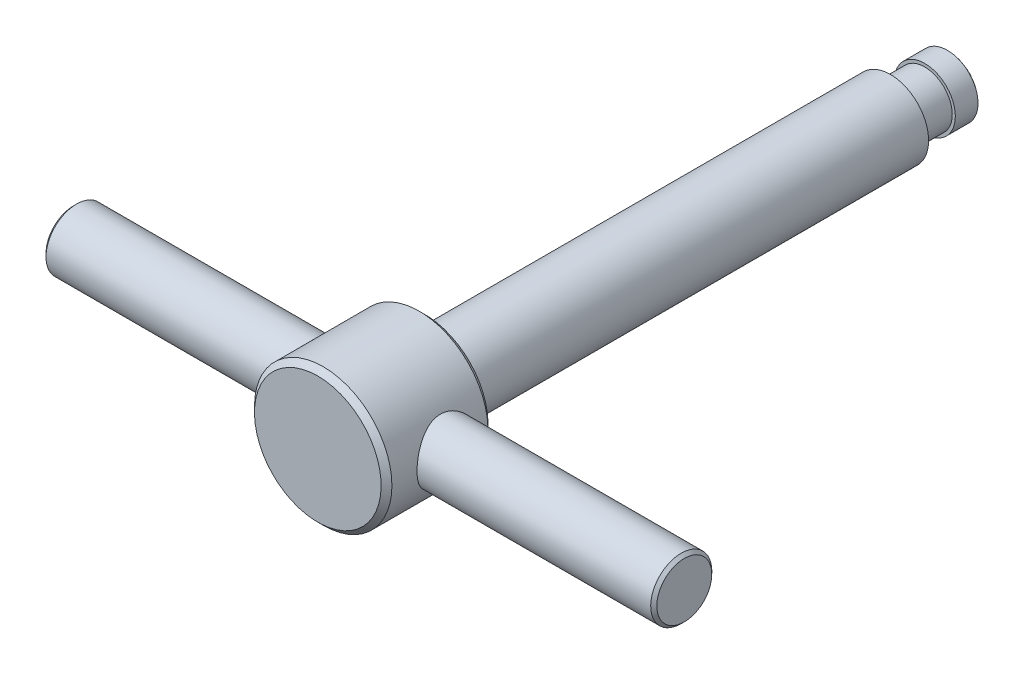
ISO-10303-21;
HEADER;
FILE_DESCRIPTION(('STEP AP214'),'2;1');
FILE_NAME('part.step','',(''),(''),'','','');
FILE_SCHEMA(('AUTOMOTIVE_DESIGN { 1 0 10303 214 1 1 1 1 }'));
ENDSEC;
DATA;
#1=APPLICATION_CONTEXT('core data for automotive mechanical design processes');
#2=APPLICATION_PROTOCOL_DEFINITION('international standard','automotive_design',2000,#1);
#3=PRODUCT_CONTEXT('',#1,'mechanical');
#4=PRODUCT('Part','Part','',(#3));
#5=PRODUCT_RELATED_PRODUCT_CATEGORY('part','',(#4));
#6=PRODUCT_DEFINITION_FORMATION('','',#4);
#7=PRODUCT_DEFINITION_CONTEXT('part definition',#1,'design');
#8=PRODUCT_DEFINITION('design','',#6,#7);
#9=PRODUCT_DEFINITION_SHAPE('','',#8);
#10=(LENGTH_UNIT() NAMED_UNIT(*) SI_UNIT(.MILLI.,.METRE.));
#11=(NAMED_UNIT(*) PLANE_ANGLE_UNIT() SI_UNIT($,.RADIAN.));
#12=(NAMED_UNIT(*) SI_UNIT($,.STERADIAN.) SOLID_ANGLE_UNIT());
#13=UNCERTAINTY_MEASURE_WITH_UNIT(LENGTH_MEASURE(1.E-05),#10,'distance_accuracy_value','');
#14=(GEOMETRIC_REPRESENTATION_CONTEXT(3) GLOBAL_UNCERTAINTY_ASSIGNED_CONTEXT((#13)) GLOBAL_UNIT_ASSIGNED_CONTEXT((#10,
#11,#12)) REPRESENTATION_CONTEXT('',''));
#15=CARTESIAN_POINT('',(0.,0.,0.));
#16=DIRECTION('',(0.,0.,1.));
#17=DIRECTION('',(1.,0.,0.));
#18=AXIS2_PLACEMENT_3D('',#15,#16,#17);
#19=CARTESIAN_POINT('',(40.,0.,79.6));
#20=DIRECTION('',(-1.,0.,0.));
#21=DIRECTION('',(0.,-1.,0.));
#22=AXIS2_PLACEMENT_3D('',#19,#20,#21);
#23=PLANE('',#22);
#24=CARTESIAN_POINT('',(40.0000000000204,0.,76.));
#25=DIRECTION('',(-1.,0.,0.));
#26=DIRECTION('',(0.,-1.,0.));
#27=AXIS2_PLACEMENT_3D('',#24,#25,#26);
#28=CIRCLE('',#27,3.59999999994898);
#29=CARTESIAN_POINT('',(40.0000000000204,-3.59999999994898,76.));
#30=VERTEX_POINT('',#29);
#31=EDGE_CURVE('E15',#30,#30,#28,.T.);
#32=ORIENTED_EDGE('',*,*,#31,.F.);
#33=EDGE_LOOP('',(#32));
#34=FACE_BOUND('',#33,.T.);
#35=ADVANCED_FACE('F12',(#34),#23,.F.);
#36=CARTESIAN_POINT('',(-40.,0.,76.));
#37=DIRECTION('',(1.,0.,0.));
#38=DIRECTION('',(0.,1.,0.));
#39=AXIS2_PLACEMENT_3D('',#36,#37,#38);
#40=PLANE('',#39);
#41=CARTESIAN_POINT('',(-40.0000000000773,0.,76.));
#42=DIRECTION('',(1.,0.,0.));
#43=DIRECTION('',(0.,1.,0.));
#44=AXIS2_PLACEMENT_3D('',#41,#42,#43);
#45=CIRCLE('',#44,3.60000000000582);
#46=CARTESIAN_POINT('',(-40.0000000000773,3.60000000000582,76.));
#47=VERTEX_POINT('',#46);
#48=EDGE_CURVE('E133',#47,#47,#45,.T.);
#49=ORIENTED_EDGE('',*,*,#48,.F.);
#50=EDGE_LOOP('',(#49));
#51=FACE_BOUND('',#50,.T.);
#52=ADVANCED_FACE('F171',(#51),#40,.F.);
#53=CARTESIAN_POINT('',(0.,0.,6.));
#54=DIRECTION('',(-1.,0.,0.));
#55=DIRECTION('',(0.,1.,0.));
#56=AXIS2_PLACEMENT_3D('',#53,#54,#55);
#57=SPHERICAL_SURFACE('',#56,6.);
#58=CARTESIAN_POINT('',(0.,0.,1.52786404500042));
#59=DIRECTION('',(0.,0.,1.));
#60=DIRECTION('',(0.,-1.,0.));
#61=AXIS2_PLACEMENT_3D('',#58,#59,#60);
#62=CIRCLE('',#61,4.);
#63=CARTESIAN_POINT('',(0.,-4.,1.52786404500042));
#64=VERTEX_POINT('',#63);
#65=EDGE_CURVE('E126',#64,#64,#62,.T.);
#66=ORIENTED_EDGE('',*,*,#65,.F.);
#67=EDGE_LOOP('',(#66));
#68=FACE_BOUND('',#67,.T.);
#69=ADVANCED_FACE('F168',(#68),#57,.T.);
#70=CARTESIAN_POINT('',(39.6000000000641,0.,76.));
#71=DIRECTION('',(-1.,0.,0.));
#72=DIRECTION('',(0.,-1.,0.));
#73=AXIS2_PLACEMENT_3D('',#70,#71,#72);
#74=CONICAL_SURFACE('',#73,3.99999999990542,0.785398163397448);
#75=CARTESIAN_POINT('',(39.6,0.,76.));
#76=DIRECTION('',(-1.,0.,0.));
#77=DIRECTION('',(0.,-1.,0.));
#78=AXIS2_PLACEMENT_3D('',#75,#76,#77);
#79=CIRCLE('',#78,4.);
#80=CARTESIAN_POINT('',(39.6,-4.,76.));
#81=VERTEX_POINT('',#80);
#82=EDGE_CURVE('E124',#81,#81,#79,.T.);
#83=ORIENTED_EDGE('',*,*,#82,.F.);
#84=EDGE_LOOP('',(#83));
#85=FACE_BOUND('',#84,.T.);
#86=ORIENTED_EDGE('',*,*,#31,.T.);
#87=EDGE_LOOP('',(#86));
#88=FACE_BOUND('',#87,.T.);
#89=ADVANCED_FACE('F164',(#85,#88),#74,.T.);
#90=CARTESIAN_POINT('',(0.,0.,84.));
#91=DIRECTION('',(0.,0.,-1.));
#92=DIRECTION('',(0.,1.,0.));
#93=AXIS2_PLACEMENT_3D('',#90,#91,#92);
#94=PLANE('',#93);
#95=CARTESIAN_POINT('',(0.,0.,84.));
#96=DIRECTION('',(0.,0.,-1.));
#97=DIRECTION('',(0.,1.,0.));
#98=AXIS2_PLACEMENT_3D('',#95,#96,#97);
#99=CIRCLE('',#98,8.29289321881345);
#100=CARTESIAN_POINT('',(0.,8.29289321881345,84.));
#101=VERTEX_POINT('',#100);
#102=EDGE_CURVE('E121',#101,#101,#99,.T.);
#103=ORIENTED_EDGE('',*,*,#102,.F.);
#104=EDGE_LOOP('',(#103));
#105=FACE_BOUND('',#104,.T.);
#106=ADVANCED_FACE('F160',(#105),#94,.F.);
#107=CARTESIAN_POINT('',(-39.6000000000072,0.,76.));
#108=DIRECTION('',(1.,0.,0.));
#109=DIRECTION('',(0.,1.,0.));
#110=AXIS2_PLACEMENT_3D('',#107,#108,#109);
#111=CONICAL_SURFACE('',#110,4.00000000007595,0.785398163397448);
#112=ORIENTED_EDGE('',*,*,#48,.T.);
#113=EDGE_LOOP('',(#112));
#114=FACE_BOUND('',#113,.T.);
#115=CARTESIAN_POINT('',(-39.6,0.,76.));
#116=DIRECTION('',(-1.,0.,0.));
#117=DIRECTION('',(0.,-1.,0.));
#118=AXIS2_PLACEMENT_3D('',#115,#116,#117);
#119=CIRCLE('',#118,4.);
#120=CARTESIAN_POINT('',(-39.6,-4.,76.));
#121=VERTEX_POINT('',#120);
#122=EDGE_CURVE('E117',#121,#121,#119,.F.);
#123=ORIENTED_EDGE('',*,*,#122,.F.);
#124=EDGE_LOOP('',(#123));
#125=FACE_BOUND('',#124,.T.);
#126=ADVANCED_FACE('F154',(#114,#125),#111,.T.);
#127=CARTESIAN_POINT('',(0.,0.,0.));
#128=DIRECTION('',(0.,0.,1.));
#129=DIRECTION('',(0.,-1.,0.));
#130=AXIS2_PLACEMENT_3D('',#127,#128,#129);
#131=CYLINDRICAL_SURFACE('',#130,4.);
#132=CARTESIAN_POINT('',(0.,0.,4.5));
#133=DIRECTION('',(0.,0.,1.));
#134=DIRECTION('',(0.,-1.,0.));
#135=AXIS2_PLACEMENT_3D('',#132,#133,#134);
#136=CIRCLE('',#135,4.);
#137=CARTESIAN_POINT('',(0.,-4.,4.5));
#138=VERTEX_POINT('',#137);
#139=EDGE_CURVE('E120',#138,#138,#136,.F.);
#140=ORIENTED_EDGE('',*,*,#139,.T.);
#141=EDGE_LOOP('',(#140));
#142=FACE_BOUND('',#141,.T.);
#143=ORIENTED_EDGE('',*,*,#65,.T.);
#144=EDGE_LOOP('',(#143));
#145=FACE_BOUND('',#144,.T.);
#146=ADVANCED_FACE('F147',(#142,#145),#131,.T.);
#147=CARTESIAN_POINT('',(40.,0.,76.));
#148=DIRECTION('',(-1.,0.,0.));
#149=DIRECTION('',(0.,-1.,0.));
#150=AXIS2_PLACEMENT_3D('',#147,#148,#149);
#151=CYLINDRICAL_SURFACE('',#150,4.);
#152=CARTESIAN_POINT('',(8.06476391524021,3.99494467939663,75.798960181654));
#153=CARTESIAN_POINT('',(8.0674363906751,3.98955069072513,75.6917916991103));
#154=CARTESIAN_POINT('',(8.07224351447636,3.97984050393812,75.5848598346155));
#155=CARTESIAN_POINT('',(8.08595698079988,3.95190310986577,75.3723346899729));
#156=CARTESIAN_POINT('',(8.09486596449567,3.93367041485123,75.2667423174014));
#157=CARTESIAN_POINT('',(8.1164936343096,3.88884963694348,75.0574951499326));
#158=CARTESIAN_POINT('',(8.1292205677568,3.8622434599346,74.9538450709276));
#159=CARTESIAN_POINT('',(8.15804439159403,3.80098041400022,74.7494181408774));
#160=CARTESIAN_POINT('',(8.17414274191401,3.76632005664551,74.6486425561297));
#161=CARTESIAN_POINT('',(8.22656181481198,3.65113741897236,74.3526432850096));
#162=CARTESIAN_POINT('',(8.26714545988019,3.55914188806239,74.1624986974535));
#163=CARTESIAN_POINT('',(8.35509007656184,3.34746985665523,73.8003347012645));
#164=CARTESIAN_POINT('',(8.40244957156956,3.22779938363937,73.6283113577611));
#165=CARTESIAN_POINT('',(8.50255442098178,2.95450812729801,73.2943598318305));
#166=CARTESIAN_POINT('',(8.55544737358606,2.79913804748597,73.1339022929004));
#167=CARTESIAN_POINT('',(8.65812797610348,2.46325909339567,72.8405540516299));
#168=CARTESIAN_POINT('',(8.70791461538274,2.28274209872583,72.707672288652));
#169=CARTESIAN_POINT('',(8.80064485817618,1.89462274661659,72.4695960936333));
#170=CARTESIAN_POINT('',(8.84333491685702,1.68636462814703,72.3653643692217));
#171=CARTESIAN_POINT('',(8.91506686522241,1.25288124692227,72.1941495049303));
#172=CARTESIAN_POINT('',(8.94411720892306,1.02766659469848,72.1271432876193));
#173=CARTESIAN_POINT('',(8.98362691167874,0.583621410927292,72.0367850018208));
#174=CARTESIAN_POINT('',(8.99524674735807,0.36545006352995,72.010702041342));
#175=CARTESIAN_POINT('',(9.00236834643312,-0.0724466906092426,71.994665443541));
#176=CARTESIAN_POINT('',(8.99787565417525,-0.292171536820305,72.0046993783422));
#177=CARTESIAN_POINT('',(8.97401242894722,-0.713505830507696,72.058754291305));
#178=CARTESIAN_POINT('',(8.95551820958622,-0.915427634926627,72.1007741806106));
#179=CARTESIAN_POINT('',(8.906496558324,-1.30907870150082,72.2147237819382));
#180=CARTESIAN_POINT('',(8.87596762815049,-1.50080669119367,72.2866572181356));
#181=CARTESIAN_POINT('',(8.80455207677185,-1.87547227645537,72.4607030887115));
#182=CARTESIAN_POINT('',(8.76336986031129,-2.05794367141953,72.5636936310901));
#183=CARTESIAN_POINT('',(8.67491934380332,-2.40367819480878,72.7959802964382));
#184=CARTESIAN_POINT('',(8.62764839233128,-2.56693289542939,72.925287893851));
#185=CARTESIAN_POINT('',(8.52733500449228,-2.8834534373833,73.2186407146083));
#186=CARTESIAN_POINT('',(8.47413447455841,-3.0348536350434,73.3846457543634));
#187=CARTESIAN_POINT('',(8.37116616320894,-3.30831958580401,73.74050517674));
#188=CARTESIAN_POINT('',(8.32139959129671,-3.43037504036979,73.9303678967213));
#189=CARTESIAN_POINT('',(8.25323791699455,-3.58991873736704,74.2319859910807));
#190=CARTESIAN_POINT('',(8.23138148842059,-3.6396163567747,74.3366658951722));
#191=CARTESIAN_POINT('',(8.1908597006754,-3.72991512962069,74.5504567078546));
#192=CARTESIAN_POINT('',(8.17219290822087,-3.77052037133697,74.6595655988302));
#193=CARTESIAN_POINT('',(8.13875174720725,-3.84217195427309,74.8813867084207));
#194=CARTESIAN_POINT('',(8.12397512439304,-3.87322383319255,74.9940967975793));
#195=CARTESIAN_POINT('',(8.09888899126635,-3.92540937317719,75.2222776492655));
#196=CARTESIAN_POINT('',(8.08857897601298,-3.94654415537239,75.337748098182));
#197=CARTESIAN_POINT('',(8.07352903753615,-3.97723443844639,75.5605112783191));
#198=CARTESIAN_POINT('',(8.06838950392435,-3.98762282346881,75.6676629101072));
#199=CARTESIAN_POINT('',(8.06239632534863,-3.99972645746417,75.8826133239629));
#200=CARTESIAN_POINT('',(8.06154410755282,-4.00143881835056,75.9904123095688));
#201=CARTESIAN_POINT('',(8.06416377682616,-3.99615739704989,76.2056866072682));
#202=CARTESIAN_POINT('',(8.06763316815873,-3.98916863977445,76.3131620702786));
#203=CARTESIAN_POINT('',(8.07875565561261,-3.96659203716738,76.5269998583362));
#204=CARTESIAN_POINT('',(8.08641032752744,-3.95100095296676,76.633361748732));
#205=CARTESIAN_POINT('',(8.11411734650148,-3.89395643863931,76.936808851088));
#206=CARTESIAN_POINT('',(8.13915387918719,-3.84181494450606,77.1315464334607));
#207=CARTESIAN_POINT('',(8.20019833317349,-3.70971266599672,77.5093683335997));
#208=CARTESIAN_POINT('',(8.23620931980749,-3.62974410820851,77.6924493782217));
#209=CARTESIAN_POINT('',(8.31800045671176,-3.43836581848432,78.054813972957));
#210=CARTESIAN_POINT('',(8.36426005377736,-3.32526432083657,78.2330954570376));
#211=CARTESIAN_POINT('',(8.4601853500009,-3.07301957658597,78.569191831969));
#212=CARTESIAN_POINT('',(8.50985275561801,-2.93386322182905,78.7269963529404));
#213=CARTESIAN_POINT('',(8.61220177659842,-2.61910352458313,79.0319010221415));
#214=CARTESIAN_POINT('',(8.66476664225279,-2.441376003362,79.1768548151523));
#215=CARTESIAN_POINT('',(8.76272732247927,-2.06222856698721,79.4350697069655));
#216=CARTESIAN_POINT('',(8.80812349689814,-1.86080984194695,79.5483323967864));
#217=CARTESIAN_POINT('',(8.86679691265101,-1.54634908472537,79.6907848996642));
#218=CARTESIAN_POINT('',(8.88470775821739,-1.44012145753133,79.7335261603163));
#219=CARTESIAN_POINT('',(8.91705638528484,-1.22393436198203,79.8098687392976));
#220=CARTESIAN_POINT('',(8.93149573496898,-1.11397660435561,79.8434741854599));
#221=CARTESIAN_POINT('',(8.95646868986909,-0.891198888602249,79.9011543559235));
#222=CARTESIAN_POINT('',(8.96700361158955,-0.778379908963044,79.9252322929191));
#223=CARTESIAN_POINT('',(8.98385549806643,-0.550776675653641,79.9635789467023));
#224=CARTESIAN_POINT('',(8.99017280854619,-0.435992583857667,79.9778484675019));
#225=CARTESIAN_POINT('',(8.99806065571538,-0.214809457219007,79.9956416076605));
#226=CARTESIAN_POINT('',(8.99997424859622,-0.108484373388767,79.9999420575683));
#227=CARTESIAN_POINT('',(9.00002524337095,0.104207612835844,80.0000567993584));
#228=CARTESIAN_POINT('',(8.9981613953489,0.210574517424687,79.9958682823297));
#229=CARTESIAN_POINT('',(8.99070376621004,0.422458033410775,79.9790467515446));
#230=CARTESIAN_POINT('',(8.98511182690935,0.527975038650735,79.9664179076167));
#231=CARTESIAN_POINT('',(8.97035313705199,0.737441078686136,79.9328682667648));
#232=CARTESIAN_POINT('',(8.96118504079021,0.841389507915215,79.9119443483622));
#233=CARTESIAN_POINT('',(8.92926991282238,1.14378810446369,79.8384680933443));
#234=CARTESIAN_POINT('',(8.9018622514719,1.33914830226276,79.7746789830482));
#235=CARTESIAN_POINT('',(8.83691701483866,1.71629114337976,79.6188512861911));
#236=CARTESIAN_POINT('',(8.79937717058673,1.8980707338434,79.5268063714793));
#237=CARTESIAN_POINT('',(8.71504520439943,2.25465298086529,79.310958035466));
#238=CARTESIAN_POINT('',(8.66784014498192,2.428424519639,79.1856110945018));
#239=CARTESIAN_POINT('',(8.57018496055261,2.75332137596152,78.9094286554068));
#240=CARTESIAN_POINT('',(8.51973331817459,2.90443599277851,78.7585811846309));
#241=CARTESIAN_POINT('',(8.41670323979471,3.19123729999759,78.4224415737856));
#242=CARTESIAN_POINT('',(8.36423990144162,3.32498176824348,78.2354353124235));
#243=CARTESIAN_POINT('',(8.29155306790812,3.50059748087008,77.9388357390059));
#244=CARTESIAN_POINT('',(8.26830941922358,3.55500246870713,77.8372003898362));
#245=CARTESIAN_POINT('',(8.22458395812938,3.65502305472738,77.6291423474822));
#246=CARTESIAN_POINT('',(8.2041007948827,3.70064295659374,77.5227220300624));
#247=CARTESIAN_POINT('',(8.16694864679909,3.78191948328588,77.3076954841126));
#248=CARTESIAN_POINT('',(8.15021891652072,3.81773722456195,77.1991606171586));
#249=CARTESIAN_POINT('',(8.12074390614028,3.88003965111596,76.9789649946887));
#250=CARTESIAN_POINT('',(8.10799658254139,3.90652912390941,76.86730587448));
#251=CARTESIAN_POINT('',(8.08700366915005,3.94980378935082,76.6420096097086));
#252=CARTESIAN_POINT('',(8.0787465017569,3.96661394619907,76.5283783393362));
#253=CARTESIAN_POINT('',(8.06702851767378,3.99039233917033,76.299903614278));
#254=CARTESIAN_POINT('',(8.06356411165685,3.99736794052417,76.1850611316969));
#255=CARTESIAN_POINT('',(8.06216903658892,4.00017832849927,76.0249404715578));
#256=CARTESIAN_POINT('',(8.06215649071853,4.00020413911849,75.9797165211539));
#257=CARTESIAN_POINT('',(8.06289099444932,3.99872351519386,75.8893011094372));
#258=CARTESIAN_POINT('',(8.06363801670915,3.99721713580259,75.8441096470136));
#259=CARTESIAN_POINT('',(8.06476391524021,3.99494467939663,75.798960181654));
#260=B_SPLINE_CURVE_WITH_KNOTS('',3,(#152,#153,#154,#155,#156,#157,#158,#159,#160,#161,#162,
#163,#164,#165,#166,#167,#168,#169,#170,#171,#172,#173,#174,#175,#176,#177,#178,#179,#180,#181,
#182,#183,#184,#185,#186,#187,#188,#189,#190,#191,#192,#193,#194,#195,#196,#197,#198,#199,#200,
#201,#202,#203,#204,#205,#206,#207,#208,#209,#210,#211,#212,#213,#214,#215,#216,#217,#218,#219,
#220,#221,#222,#223,#224,#225,#226,#227,#228,#229,#230,#231,#232,#233,#234,#235,#236,#237,#238,
#239,#240,#241,#242,#243,#244,#245,#246,#247,#248,#249,#250,#251,#252,#253,#254,#255,#256,#257,
#258,#259),.UNSPECIFIED.,.T.,.F.,(4,2,2,2,2,2,2,2,2,2,2,2,2,2,2,2,2,2,2,2,2,2,2,2,2,2,2,2,2,2,2,
2,2,2,2,2,2,2,2,2,2,2,2,2,2,2,2,2,2,2,2,2,2,4),(0.,0.321964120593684,0.644135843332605,
0.967008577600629,1.29002141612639,1.93223985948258,2.57431856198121,3.25984229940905,
3.94558792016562,4.65214585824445,5.35826528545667,6.01488562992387,6.67128005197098,
7.28967668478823,7.90815032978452,8.5460780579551,9.18428452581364,9.8739300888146,
10.5638173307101,10.9171864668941,11.2703963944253,11.6234011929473,11.9763660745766,
12.2992695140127,12.6222804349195,12.945104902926,13.2680510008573,13.8745774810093,
14.4812735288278,15.1270009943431,15.7730542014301,16.4756628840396,17.1782362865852,
17.5255354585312,17.872677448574,18.2197022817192,18.566698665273,18.8855869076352,
19.20458068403,19.5234169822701,19.8423733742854,20.4613785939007,21.0805225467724,
21.7359055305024,22.3915970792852,23.095340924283,23.4477730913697,23.8000321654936,
24.1460959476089,24.4919818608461,24.8369716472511,25.1817029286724,25.3173494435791,
25.4529910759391),.UNSPECIFIED.);
#261=CARTESIAN_POINT('',(8.06476391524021,3.99494467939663,75.798960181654));
#262=VERTEX_POINT('',#261);
#263=EDGE_CURVE('E46',#262,#262,#260,.T.);
#264=ORIENTED_EDGE('',*,*,#263,.F.);
#265=EDGE_LOOP('',(#264));
#266=FACE_BOUND('',#265,.T.);
#267=ORIENTED_EDGE('',*,*,#82,.T.);
#268=EDGE_LOOP('',(#267));
#269=FACE_BOUND('',#268,.T.);
#270=ADVANCED_FACE('F145',(#266,#269),#151,.T.);
#271=CARTESIAN_POINT('',(0.,0.,83.2928932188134));
#272=DIRECTION('',(0.,0.,-1.));
#273=DIRECTION('',(0.,1.,0.));
#274=AXIS2_PLACEMENT_3D('',#271,#272,#273);
#275=CONICAL_SURFACE('',#274,9.,0.785398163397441);
#276=ORIENTED_EDGE('',*,*,#102,.T.);
#277=EDGE_LOOP('',(#276));
#278=FACE_BOUND('',#277,.T.);
#279=CARTESIAN_POINT('',(0.,0.,83.2928932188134));
#280=DIRECTION('',(0.,0.,1.));
#281=DIRECTION('',(0.,-1.,0.));
#282=AXIS2_PLACEMENT_3D('',#279,#280,#281);
#283=CIRCLE('',#282,9.);
#284=CARTESIAN_POINT('',(0.,-9.,83.2928932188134));
#285=VERTEX_POINT('',#284);
#286=EDGE_CURVE('E45',#285,#285,#283,.F.);
#287=ORIENTED_EDGE('',*,*,#286,.F.);
#288=EDGE_LOOP('',(#287));
#289=FACE_BOUND('',#288,.T.);
#290=ADVANCED_FACE('F72',(#278,#289),#275,.T.);
#291=CARTESIAN_POINT('',(40.,0.,76.));
#292=DIRECTION('',(-1.,0.,0.));
#293=DIRECTION('',(0.,-1.,0.));
#294=AXIS2_PLACEMENT_3D('',#291,#292,#293);
#295=CYLINDRICAL_SURFACE('',#294,4.);
#296=ORIENTED_EDGE('',*,*,#122,.T.);
#297=EDGE_LOOP('',(#296));
#298=FACE_BOUND('',#297,.T.);
#299=CARTESIAN_POINT('',(-8.06476391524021,3.99494467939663,76.2010398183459));
#300=CARTESIAN_POINT('',(-8.0674363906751,3.98955069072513,76.3082083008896));
#301=CARTESIAN_POINT('',(-8.07224351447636,3.97984050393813,76.4151401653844));
#302=CARTESIAN_POINT('',(-8.08595698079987,3.95190310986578,76.6276653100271));
#303=CARTESIAN_POINT('',(-8.09486596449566,3.93367041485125,76.7332576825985));
#304=CARTESIAN_POINT('',(-8.1164936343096,3.88884963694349,76.9425048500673));
#305=CARTESIAN_POINT('',(-8.1292205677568,3.8622434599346,77.0461549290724));
#306=CARTESIAN_POINT('',(-8.15804439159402,3.80098041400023,77.2505818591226));
#307=CARTESIAN_POINT('',(-8.174142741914,3.76632005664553,77.3513574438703));
#308=CARTESIAN_POINT('',(-8.22656181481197,3.65113741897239,77.6473567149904));
#309=CARTESIAN_POINT('',(-8.26714545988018,3.55914188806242,77.8375013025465));
#310=CARTESIAN_POINT('',(-8.35509007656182,3.34746985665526,78.1996652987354));
#311=CARTESIAN_POINT('',(-8.40244957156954,3.22779938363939,78.3716886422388));
#312=CARTESIAN_POINT('',(-8.50255442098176,2.95450812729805,78.7056401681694));
#313=CARTESIAN_POINT('',(-8.55544737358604,2.79913804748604,78.8660977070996));
#314=CARTESIAN_POINT('',(-8.65812797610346,2.46325909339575,79.15944594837));
#315=CARTESIAN_POINT('',(-8.70791461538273,2.28274209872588,79.2923277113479));
#316=CARTESIAN_POINT('',(-8.80064485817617,1.89462274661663,79.5304039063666));
#317=CARTESIAN_POINT('',(-8.84333491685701,1.68636462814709,79.6346356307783));
#318=CARTESIAN_POINT('',(-8.9150668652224,1.25288124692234,79.8058504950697));
#319=CARTESIAN_POINT('',(-8.94411720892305,1.02766659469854,79.8728567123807));
#320=CARTESIAN_POINT('',(-8.98362691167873,0.583621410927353,79.9632149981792));
#321=CARTESIAN_POINT('',(-8.99524674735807,0.365450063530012,79.989297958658));
#322=CARTESIAN_POINT('',(-9.00236834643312,-0.072446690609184,80.005334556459));
#323=CARTESIAN_POINT('',(-8.99787565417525,-0.292171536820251,79.9953006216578));
#324=CARTESIAN_POINT('',(-8.97401242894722,-0.713505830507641,79.941245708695));
#325=CARTESIAN_POINT('',(-8.95551820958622,-0.915427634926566,79.8992258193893));
#326=CARTESIAN_POINT('',(-8.90649655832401,-1.30907870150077,79.7852762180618));
#327=CARTESIAN_POINT('',(-8.8759676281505,-1.50080669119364,79.7133427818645));
#328=CARTESIAN_POINT('',(-8.80455207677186,-1.87547227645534,79.5392969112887));
#329=CARTESIAN_POINT('',(-8.7633698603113,-2.05794367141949,79.4363063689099));
#330=CARTESIAN_POINT('',(-8.67491934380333,-2.40367819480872,79.2040197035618));
#331=CARTESIAN_POINT('',(-8.6276483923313,-2.56693289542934,79.0747121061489));
#332=CARTESIAN_POINT('',(-8.52733500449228,-2.88345343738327,78.7813592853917));
#333=CARTESIAN_POINT('',(-8.47413447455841,-3.03485363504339,78.6153542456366));
#334=CARTESIAN_POINT('',(-8.37116616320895,-3.30831958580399,78.25949482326));
#335=CARTESIAN_POINT('',(-8.32139959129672,-3.43037504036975,78.0696321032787));
#336=CARTESIAN_POINT('',(-8.25323791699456,-3.58991873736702,77.7680140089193));
#337=CARTESIAN_POINT('',(-8.23138148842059,-3.63961635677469,77.6633341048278));
#338=CARTESIAN_POINT('',(-8.19085970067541,-3.72991512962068,77.4495432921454));
#339=CARTESIAN_POINT('',(-8.17219290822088,-3.77052037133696,77.3404344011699));
#340=CARTESIAN_POINT('',(-8.13875174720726,-3.84217195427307,77.1186132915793));
#341=CARTESIAN_POINT('',(-8.12397512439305,-3.87322383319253,77.0059032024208));
#342=CARTESIAN_POINT('',(-8.09888899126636,-3.92540937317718,76.7777223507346));
#343=CARTESIAN_POINT('',(-8.08857897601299,-3.94654415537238,76.6622519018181));
#344=CARTESIAN_POINT('',(-8.07352903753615,-3.97723443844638,76.439488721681));
#345=CARTESIAN_POINT('',(-8.06838950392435,-3.98762282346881,76.3323370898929));
#346=CARTESIAN_POINT('',(-8.06239632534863,-3.99972645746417,76.1173866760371));
#347=CARTESIAN_POINT('',(-8.06154410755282,-4.00143881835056,76.0095876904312));
#348=CARTESIAN_POINT('',(-8.06416377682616,-3.99615739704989,75.7943133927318));
#349=CARTESIAN_POINT('',(-8.06763316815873,-3.98916863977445,75.6868379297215));
#350=CARTESIAN_POINT('',(-8.0787556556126,-3.96659203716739,75.4730001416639));
#351=CARTESIAN_POINT('',(-8.08641032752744,-3.95100095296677,75.366638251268));
#352=CARTESIAN_POINT('',(-8.11411734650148,-3.89395643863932,75.063191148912));
#353=CARTESIAN_POINT('',(-8.13915387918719,-3.84181494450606,74.8684535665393));
#354=CARTESIAN_POINT('',(-8.20019833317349,-3.70971266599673,74.4906316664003));
#355=CARTESIAN_POINT('',(-8.23620931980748,-3.62974410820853,74.3075506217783));
#356=CARTESIAN_POINT('',(-8.31800045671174,-3.43836581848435,73.9451860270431));
#357=CARTESIAN_POINT('',(-8.36426005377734,-3.32526432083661,73.7669045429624));
#358=CARTESIAN_POINT('',(-8.46018535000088,-3.07301957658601,73.430808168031));
#359=CARTESIAN_POINT('',(-8.509852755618,-2.93386322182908,73.2730036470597));
#360=CARTESIAN_POINT('',(-8.61220177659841,-2.61910352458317,72.9680989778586));
#361=CARTESIAN_POINT('',(-8.66476664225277,-2.44137600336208,72.8231451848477));
#362=CARTESIAN_POINT('',(-8.76272732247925,-2.06222856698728,72.5649302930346));
#363=CARTESIAN_POINT('',(-8.80812349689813,-1.86080984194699,72.4516676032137));
#364=CARTESIAN_POINT('',(-8.866796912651,-1.54634908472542,72.3092151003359));
#365=CARTESIAN_POINT('',(-8.88470775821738,-1.44012145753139,72.2664738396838));
#366=CARTESIAN_POINT('',(-8.91705638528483,-1.22393436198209,72.1901312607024));
#367=CARTESIAN_POINT('',(-8.93149573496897,-1.11397660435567,72.1565258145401));
#368=CARTESIAN_POINT('',(-8.95646868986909,-0.891198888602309,72.0988456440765));
#369=CARTESIAN_POINT('',(-8.96700361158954,-0.778379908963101,72.0747677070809));
#370=CARTESIAN_POINT('',(-8.98385549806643,-0.550776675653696,72.0364210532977));
#371=CARTESIAN_POINT('',(-8.99017280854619,-0.435992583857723,72.0221515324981));
#372=CARTESIAN_POINT('',(-8.99806065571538,-0.214809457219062,72.0043583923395));
#373=CARTESIAN_POINT('',(-8.99997424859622,-0.108484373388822,72.0000579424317));
#374=CARTESIAN_POINT('',(-9.00002524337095,0.10420761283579,71.9999432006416));
#375=CARTESIAN_POINT('',(-8.9981613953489,0.210574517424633,72.0041317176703));
#376=CARTESIAN_POINT('',(-8.99070376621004,0.422458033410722,72.0209532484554));
#377=CARTESIAN_POINT('',(-8.98511182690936,0.527975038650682,72.0335820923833));
#378=CARTESIAN_POINT('',(-8.97035313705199,0.737441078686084,72.0671317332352));
#379=CARTESIAN_POINT('',(-8.96118504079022,0.841389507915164,72.0880556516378));
#380=CARTESIAN_POINT('',(-8.92926991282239,1.14378810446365,72.1615319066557));
#381=CARTESIAN_POINT('',(-8.90186225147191,1.33914830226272,72.2253210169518));
#382=CARTESIAN_POINT('',(-8.83691701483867,1.71629114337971,72.3811487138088));
#383=CARTESIAN_POINT('',(-8.79937717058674,1.89807073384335,72.4731936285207));
#384=CARTESIAN_POINT('',(-8.71504520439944,2.25465298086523,72.689041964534));
#385=CARTESIAN_POINT('',(-8.66784014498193,2.42842451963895,72.8143889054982));
#386=CARTESIAN_POINT('',(-8.57018496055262,2.75332137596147,73.0905713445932));
#387=CARTESIAN_POINT('',(-8.51973331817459,2.90443599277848,73.241418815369));
#388=CARTESIAN_POINT('',(-8.41670323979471,3.19123729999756,73.5775584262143));
#389=CARTESIAN_POINT('',(-8.36423990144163,3.32498176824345,73.7645646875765));
#390=CARTESIAN_POINT('',(-8.29155306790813,3.50059748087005,74.061164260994));
#391=CARTESIAN_POINT('',(-8.26830941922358,3.55500246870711,74.1627996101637));
#392=CARTESIAN_POINT('',(-8.22458395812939,3.65502305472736,74.3708576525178));
#393=CARTESIAN_POINT('',(-8.20410079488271,3.70064295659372,74.4772779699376));
#394=CARTESIAN_POINT('',(-8.1669486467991,3.78191948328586,74.6923045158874));
#395=CARTESIAN_POINT('',(-8.15021891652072,3.81773722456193,74.8008393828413));
#396=CARTESIAN_POINT('',(-8.12074390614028,3.88003965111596,75.0210350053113));
#397=CARTESIAN_POINT('',(-8.10799658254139,3.9065291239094,75.13269412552));
#398=CARTESIAN_POINT('',(-8.08700366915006,3.94980378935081,75.3579903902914));
#399=CARTESIAN_POINT('',(-8.07874650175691,3.96661394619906,75.4716216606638));
#400=CARTESIAN_POINT('',(-8.06702851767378,3.99039233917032,75.7000963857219));
#401=CARTESIAN_POINT('',(-8.06356411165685,3.99736794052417,75.814938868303));
#402=CARTESIAN_POINT('',(-8.06216903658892,4.00017832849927,75.9750595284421));
#403=CARTESIAN_POINT('',(-8.06215649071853,4.00020413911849,76.020283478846));
#404=CARTESIAN_POINT('',(-8.06289099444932,3.99872351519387,76.1106988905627));
#405=CARTESIAN_POINT('',(-8.06363801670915,3.99721713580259,76.1558903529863));
#406=CARTESIAN_POINT('',(-8.06476391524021,3.99494467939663,76.2010398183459));
#407=B_SPLINE_CURVE_WITH_KNOTS('',3,(#299,#300,#301,#302,#303,#304,#305,#306,#307,#308,#309,
#310,#311,#312,#313,#314,#315,#316,#317,#318,#319,#320,#321,#322,#323,#324,#325,#326,#327,#328,
#329,#330,#331,#332,#333,#334,#335,#336,#337,#338,#339,#340,#341,#342,#343,#344,#345,#346,#347,
#348,#349,#350,#351,#352,#353,#354,#355,#356,#357,#358,#359,#360,#361,#362,#363,#364,#365,#366,
#367,#368,#369,#370,#371,#372,#373,#374,#375,#376,#377,#378,#379,#380,#381,#382,#383,#384,#385,
#386,#387,#388,#389,#390,#391,#392,#393,#394,#395,#396,#397,#398,#399,#400,#401,#402,#403,#404,
#405,#406),.UNSPECIFIED.,.T.,.F.,(4,2,2,2,2,2,2,2,2,2,2,2,2,2,2,2,2,2,2,2,2,2,2,2,2,2,2,2,2,2,2,
2,2,2,2,2,2,2,2,2,2,2,2,2,2,2,2,2,2,2,2,2,2,4),(0.,0.32196412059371,0.644135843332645,
0.967008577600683,1.29002141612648,1.93223985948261,2.57431856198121,3.25984229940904,
3.94558792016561,4.65214585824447,5.3582652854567,6.0148856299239,6.67128005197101,
7.28967668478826,7.90815032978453,8.54607805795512,9.18428452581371,9.87393008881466,
10.5638173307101,10.9171864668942,11.2703963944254,11.6234011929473,11.9763660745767,
12.2992695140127,12.6222804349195,12.945104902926,13.2680510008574,13.8745774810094,
14.4812735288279,15.1270009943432,15.7730542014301,16.4756628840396,17.1782362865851,
17.5255354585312,17.872677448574,18.2197022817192,18.5666986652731,18.8855869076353,
19.20458068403,19.5234169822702,19.8423733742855,20.4613785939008,21.0805225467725,
21.7359055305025,22.3915970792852,23.095340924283,23.4477730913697,23.8000321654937,
24.1460959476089,24.4919818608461,24.8369716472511,25.1817029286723,25.3173494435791,
25.4529910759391),.UNSPECIFIED.);
#408=CARTESIAN_POINT('',(-8.06476391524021,3.99494467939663,76.2010398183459));
#409=VERTEX_POINT('',#408);
#410=EDGE_CURVE('E37',#409,#409,#407,.T.);
#411=ORIENTED_EDGE('',*,*,#410,.F.);
#412=EDGE_LOOP('',(#411));
#413=FACE_BOUND('',#412,.T.);
#414=ADVANCED_FACE('F52',(#298,#413),#295,.T.);
#415=CARTESIAN_POINT('',(3.6,0.,4.5));
#416=DIRECTION('',(0.,0.,-1.));
#417=DIRECTION('',(0.,1.,0.));
#418=AXIS2_PLACEMENT_3D('',#415,#416,#417);
#419=PLANE('',#418);
#420=CARTESIAN_POINT('',(0.,0.,4.5));
#421=DIRECTION('',(0.,0.,1.));
#422=DIRECTION('',(0.,-1.,0.));
#423=AXIS2_PLACEMENT_3D('',#420,#421,#422);
#424=CIRCLE('',#423,3.6);
#425=CARTESIAN_POINT('',(0.,-3.6,4.5));
#426=VERTEX_POINT('',#425);
#427=EDGE_CURVE('E33',#426,#426,#424,.T.);
#428=ORIENTED_EDGE('',*,*,#427,.F.);
#429=EDGE_LOOP('',(#428));
#430=FACE_BOUND('',#429,.T.);
#431=ORIENTED_EDGE('',*,*,#139,.F.);
#432=EDGE_LOOP('',(#431));
#433=FACE_BOUND('',#432,.T.);
#434=ADVANCED_FACE('F61',(#430,#433),#419,.F.);
#435=CARTESIAN_POINT('',(0.,0.,0.));
#436=DIRECTION('',(0.,0.,1.));
#437=DIRECTION('',(0.,-1.,0.));
#438=AXIS2_PLACEMENT_3D('',#435,#436,#437);
#439=CYLINDRICAL_SURFACE('',#438,9.);
#440=ORIENTED_EDGE('',*,*,#410,.T.);
#441=EDGE_LOOP('',(#440));
#442=FACE_BOUND('',#441,.T.);
#443=ORIENTED_EDGE('',*,*,#286,.T.);
#444=EDGE_LOOP('',(#443));
#445=FACE_BOUND('',#444,.T.);
#446=ORIENTED_EDGE('',*,*,#263,.T.);
#447=EDGE_LOOP('',(#446));
#448=FACE_BOUND('',#447,.T.);
#449=CARTESIAN_POINT('',(0.,0.,70.7071067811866));
#450=DIRECTION('',(0.,0.,1.));
#451=DIRECTION('',(0.,-1.,0.));
#452=AXIS2_PLACEMENT_3D('',#449,#450,#451);
#453=CIRCLE('',#452,9.);
#454=CARTESIAN_POINT('',(0.,-9.,70.7071067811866));
#455=VERTEX_POINT('',#454);
#456=EDGE_CURVE('E36',#455,#455,#453,.F.);
#457=ORIENTED_EDGE('',*,*,#456,.F.);
#458=EDGE_LOOP('',(#457));
#459=FACE_BOUND('',#458,.T.);
#460=ADVANCED_FACE('F56',(#442,#445,#448,#459),#439,.T.);
#461=CARTESIAN_POINT('',(0.,0.,0.));
#462=DIRECTION('',(0.,0.,1.));
#463=DIRECTION('',(0.,-1.,0.));
#464=AXIS2_PLACEMENT_3D('',#461,#462,#463);
#465=CYLINDRICAL_SURFACE('',#464,3.6);
#466=CARTESIAN_POINT('',(0.,0.,8.19170962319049));
#467=DIRECTION('',(0.,0.,1.));
#468=DIRECTION('',(0.,-1.,0.));
#469=AXIS2_PLACEMENT_3D('',#466,#467,#468);
#470=CIRCLE('',#469,3.60000000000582);
#471=CARTESIAN_POINT('',(0.,-3.60000000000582,8.19170962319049));
#472=VERTEX_POINT('',#471);
#473=EDGE_CURVE('E32',#472,#472,#470,.T.);
#474=ORIENTED_EDGE('',*,*,#473,.F.);
#475=EDGE_LOOP('',(#474));
#476=FACE_BOUND('',#475,.T.);
#477=ORIENTED_EDGE('',*,*,#427,.T.);
#478=EDGE_LOOP('',(#477));
#479=FACE_BOUND('',#478,.T.);
#480=ADVANCED_FACE('F60',(#476,#479),#465,.T.);
#481=CARTESIAN_POINT('',(0.,0.,70.7071067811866));
#482=DIRECTION('',(0.,0.,1.));
#483=DIRECTION('',(0.,-1.,0.));
#484=AXIS2_PLACEMENT_3D('',#481,#482,#483);
#485=CONICAL_SURFACE('',#484,9.,0.785398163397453);
#486=ORIENTED_EDGE('',*,*,#456,.T.);
#487=EDGE_LOOP('',(#486));
#488=FACE_BOUND('',#487,.T.);
#489=CARTESIAN_POINT('',(0.,0.,70.));
#490=DIRECTION('',(0.,0.,1.));
#491=DIRECTION('',(0.,-1.,0.));
#492=AXIS2_PLACEMENT_3D('',#489,#490,#491);
#493=CIRCLE('',#492,8.29289321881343);
#494=CARTESIAN_POINT('',(0.,-8.29289321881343,70.));
#495=VERTEX_POINT('',#494);
#496=EDGE_CURVE('E24',#495,#495,#493,.T.);
#497=ORIENTED_EDGE('',*,*,#496,.T.);
#498=EDGE_LOOP('',(#497));
#499=FACE_BOUND('',#498,.T.);
#500=ADVANCED_FACE('F90',(#488,#499),#485,.T.);
#501=CARTESIAN_POINT('',(0.,0.,9.00000000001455));
#502=DIRECTION('',(0.,0.,1.));
#503=DIRECTION('',(0.,-1.,0.));
#504=AXIS2_PLACEMENT_3D('',#501,#502,#503);
#505=CONICAL_SURFACE('',#504,4.99999999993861,1.047197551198);
#506=CARTESIAN_POINT('',(0.,0.,9.));
#507=DIRECTION('',(0.,0.,1.));
#508=DIRECTION('',(0.,-1.,0.));
#509=AXIS2_PLACEMENT_3D('',#506,#507,#508);
#510=CIRCLE('',#509,5.);
#511=CARTESIAN_POINT('',(0.,-5.,9.));
#512=VERTEX_POINT('',#511);
#513=EDGE_CURVE('E19',#512,#512,#510,.T.);
#514=ORIENTED_EDGE('',*,*,#513,.F.);
#515=EDGE_LOOP('',(#514));
#516=FACE_BOUND('',#515,.T.);
#517=ORIENTED_EDGE('',*,*,#473,.T.);
#518=EDGE_LOOP('',(#517));
#519=FACE_BOUND('',#518,.T.);
#520=ADVANCED_FACE('F84',(#516,#519),#505,.T.);
#521=CARTESIAN_POINT('',(8.29289321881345,0.,70.));
#522=DIRECTION('',(0.,0.,1.));
#523=DIRECTION('',(0.,-1.,0.));
#524=AXIS2_PLACEMENT_3D('',#521,#522,#523);
#525=PLANE('',#524);
#526=ORIENTED_EDGE('',*,*,#496,.F.);
#527=EDGE_LOOP('',(#526));
#528=FACE_BOUND('',#527,.T.);
#529=CARTESIAN_POINT('',(0.,0.,70.));
#530=DIRECTION('',(0.,0.,1.));
#531=DIRECTION('',(0.,-1.,0.));
#532=AXIS2_PLACEMENT_3D('',#529,#530,#531);
#533=CIRCLE('',#532,5.);
#534=CARTESIAN_POINT('',(0.,-5.,70.));
#535=VERTEX_POINT('',#534);
#536=EDGE_CURVE('E8',#535,#535,#533,.F.);
#537=ORIENTED_EDGE('',*,*,#536,.F.);
#538=EDGE_LOOP('',(#537));
#539=FACE_BOUND('',#538,.T.);
#540=ADVANCED_FACE('F78',(#528,#539),#525,.F.);
#541=CARTESIAN_POINT('',(0.,0.,0.));
#542=DIRECTION('',(0.,0.,1.));
#543=DIRECTION('',(0.,-1.,0.));
#544=AXIS2_PLACEMENT_3D('',#541,#542,#543);
#545=CYLINDRICAL_SURFACE('',#544,5.);
#546=ORIENTED_EDGE('',*,*,#536,.T.);
#547=EDGE_LOOP('',(#546));
#548=FACE_BOUND('',#547,.T.);
#549=ORIENTED_EDGE('',*,*,#513,.T.);
#550=EDGE_LOOP('',(#549));
#551=FACE_BOUND('',#550,.T.);
#552=ADVANCED_FACE('F76',(#548,#551),#545,.T.);
#553=CLOSED_SHELL('',(#35,#52,#69,#89,#106,#126,#146,#270,#290,#414,#434,#460,#480,#500,#520,
#540,#552));
#554=MANIFOLD_SOLID_BREP('B1',#553);
#555=ADVANCED_BREP_SHAPE_REPRESENTATION('',(#18,#554),#14);
#556=SHAPE_DEFINITION_REPRESENTATION(#9,#555);
ENDSEC;
END-ISO-10303-21;
